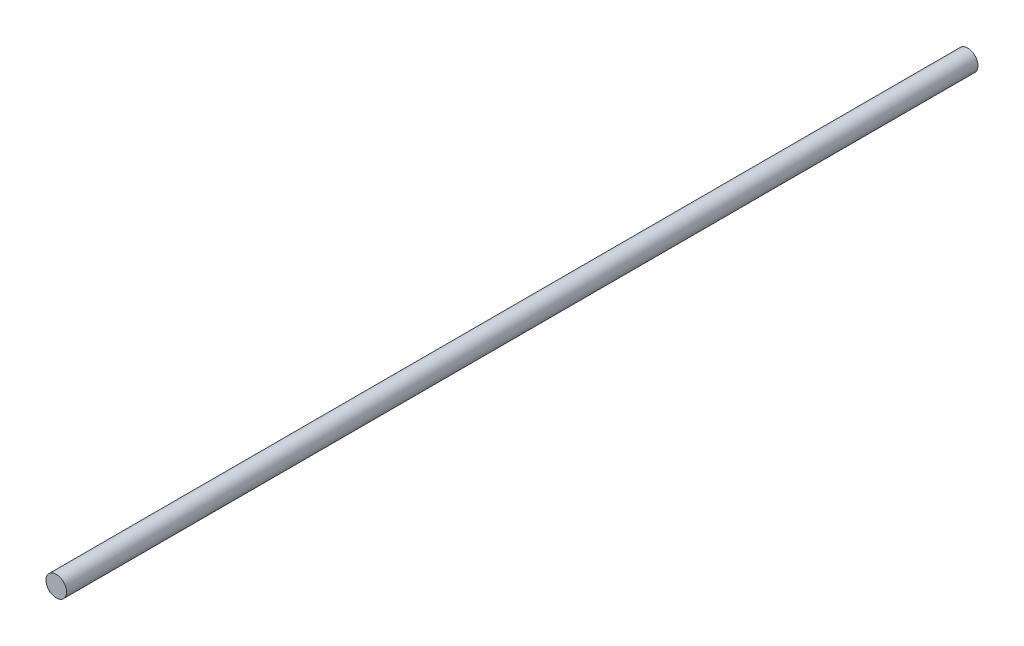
ISO-10303-21;
HEADER;
FILE_DESCRIPTION(('STEP AP214'),'2;1');
FILE_NAME('part.step','',(''),(''),'','','');
FILE_SCHEMA(('AUTOMOTIVE_DESIGN { 1 0 10303 214 1 1 1 1 }'));
ENDSEC;
DATA;
#1=APPLICATION_CONTEXT('core data for automotive mechanical design processes');
#2=APPLICATION_PROTOCOL_DEFINITION('international standard','automotive_design',2000,#1);
#3=PRODUCT_CONTEXT('',#1,'mechanical');
#4=PRODUCT('Part','Part','',(#3));
#5=PRODUCT_RELATED_PRODUCT_CATEGORY('part','',(#4));
#6=PRODUCT_DEFINITION_FORMATION('','',#4);
#7=PRODUCT_DEFINITION_CONTEXT('part definition',#1,'design');
#8=PRODUCT_DEFINITION('design','',#6,#7);
#9=PRODUCT_DEFINITION_SHAPE('','',#8);
#10=(LENGTH_UNIT() NAMED_UNIT(*) SI_UNIT(.MILLI.,.METRE.));
#11=(NAMED_UNIT(*) PLANE_ANGLE_UNIT() SI_UNIT($,.RADIAN.));
#12=(NAMED_UNIT(*) SI_UNIT($,.STERADIAN.) SOLID_ANGLE_UNIT());
#13=UNCERTAINTY_MEASURE_WITH_UNIT(LENGTH_MEASURE(1.E-05),#10,'distance_accuracy_value','');
#14=(GEOMETRIC_REPRESENTATION_CONTEXT(3) GLOBAL_UNCERTAINTY_ASSIGNED_CONTEXT((#13)) GLOBAL_UNIT_ASSIGNED_CONTEXT((#10,
#11,#12)) REPRESENTATION_CONTEXT('',''));
#15=CARTESIAN_POINT('',(0.,0.,0.));
#16=DIRECTION('',(0.,0.,1.));
#17=DIRECTION('',(1.,0.,0.));
#18=AXIS2_PLACEMENT_3D('',#15,#16,#17);
#19=CARTESIAN_POINT('',(0.,0.,355.));
#20=DIRECTION('',(0.,0.,-1.));
#21=DIRECTION('',(-1.,0.,0.));
#22=AXIS2_PLACEMENT_3D('',#19,#20,#21);
#23=CYLINDRICAL_SURFACE('',#22,4.);
#24=CARTESIAN_POINT('',(0.,0.,355.));
#25=DIRECTION('',(0.,0.,1.));
#26=DIRECTION('',(1.,0.,0.));
#27=AXIS2_PLACEMENT_3D('',#24,#25,#26);
#28=CIRCLE('',#27,4.);
#29=CARTESIAN_POINT('',(4.,0.,355.));
#30=VERTEX_POINT('',#29);
#31=EDGE_CURVE('E10',#30,#30,#28,.T.);
#32=ORIENTED_EDGE('',*,*,#31,.F.);
#33=EDGE_LOOP('',(#32));
#34=FACE_BOUND('',#33,.T.);
#35=CARTESIAN_POINT('',(0.,0.,0.));
#36=DIRECTION('',(0.,0.,1.));
#37=DIRECTION('',(1.,0.,0.));
#38=AXIS2_PLACEMENT_3D('',#35,#36,#37);
#39=CIRCLE('',#38,4.);
#40=CARTESIAN_POINT('',(4.,0.,0.));
#41=VERTEX_POINT('',#40);
#42=EDGE_CURVE('E34',#41,#41,#39,.T.);
#43=ORIENTED_EDGE('',*,*,#42,.T.);
#44=EDGE_LOOP('',(#43));
#45=FACE_BOUND('',#44,.T.);
#46=ADVANCED_FACE('F31',(#34,#45),#23,.T.);
#47=CARTESIAN_POINT('',(0.,0.,355.));
#48=DIRECTION('',(0.,0.,1.));
#49=DIRECTION('',(1.,0.,0.));
#50=AXIS2_PLACEMENT_3D('',#47,#48,#49);
#51=PLANE('',#50);
#52=ORIENTED_EDGE('',*,*,#31,.T.);
#53=EDGE_LOOP('',(#52));
#54=FACE_BOUND('',#53,.T.);
#55=ADVANCED_FACE('F46',(#54),#51,.T.);
#56=CARTESIAN_POINT('',(0.,0.,0.));
#57=DIRECTION('',(0.,0.,1.));
#58=DIRECTION('',(1.,0.,0.));
#59=AXIS2_PLACEMENT_3D('',#56,#57,#58);
#60=PLANE('',#59);
#61=ORIENTED_EDGE('',*,*,#42,.F.);
#62=EDGE_LOOP('',(#61));
#63=FACE_BOUND('',#62,.T.);
#64=ADVANCED_FACE('F44',(#63),#60,.F.);
#65=CLOSED_SHELL('',(#46,#55,#64));
#66=MANIFOLD_SOLID_BREP('B2',#65);
#67=ADVANCED_BREP_SHAPE_REPRESENTATION('',(#18,#66),#14);
#68=SHAPE_DEFINITION_REPRESENTATION(#9,#67);
ENDSEC;
END-ISO-10303-21;
